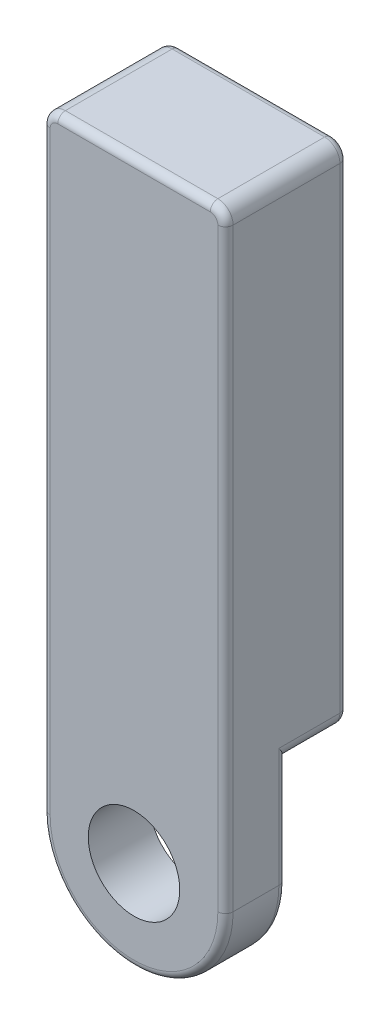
ISO-10303-21;
HEADER;
FILE_DESCRIPTION(('STEP AP214'),'2;1');
FILE_NAME('part.step','',(''),(''),'','','');
FILE_SCHEMA(('AUTOMOTIVE_DESIGN { 1 0 10303 214 1 1 1 1 }'));
ENDSEC;
DATA;
#1=APPLICATION_CONTEXT('core data for automotive mechanical design processes');
#2=APPLICATION_PROTOCOL_DEFINITION('international standard','automotive_design',2000,#1);
#3=PRODUCT_CONTEXT('',#1,'mechanical');
#4=PRODUCT('Part','Part','',(#3));
#5=PRODUCT_RELATED_PRODUCT_CATEGORY('part','',(#4));
#6=PRODUCT_DEFINITION_FORMATION('','',#4);
#7=PRODUCT_DEFINITION_CONTEXT('part definition',#1,'design');
#8=PRODUCT_DEFINITION('design','',#6,#7);
#9=PRODUCT_DEFINITION_SHAPE('','',#8);
#10=(LENGTH_UNIT() NAMED_UNIT(*) SI_UNIT(.MILLI.,.METRE.));
#11=(NAMED_UNIT(*) PLANE_ANGLE_UNIT() SI_UNIT($,.RADIAN.));
#12=(NAMED_UNIT(*) SI_UNIT($,.STERADIAN.) SOLID_ANGLE_UNIT());
#13=UNCERTAINTY_MEASURE_WITH_UNIT(LENGTH_MEASURE(1.E-05),#10,'distance_accuracy_value','');
#14=(GEOMETRIC_REPRESENTATION_CONTEXT(3) GLOBAL_UNCERTAINTY_ASSIGNED_CONTEXT((#13)) GLOBAL_UNIT_ASSIGNED_CONTEXT((#10,
#11,#12)) REPRESENTATION_CONTEXT('',''));
#15=CARTESIAN_POINT('',(0.,0.,0.));
#16=DIRECTION('',(0.,0.,1.));
#17=DIRECTION('',(1.,0.,0.));
#18=AXIS2_PLACEMENT_3D('',#15,#16,#17);
#19=CARTESIAN_POINT('',(0.,0.,25.4));
#20=DIRECTION('',(0.,0.,-1.));
#21=DIRECTION('',(-1.,0.,0.));
#22=AXIS2_PLACEMENT_3D('',#19,#20,#21);
#23=CYLINDRICAL_SURFACE('',#22,19.05);
#24=DIRECTION('',(0.,0.,-1.));
#25=VECTOR('',#24,1.);
#26=CARTESIAN_POINT('',(-19.05,0.,25.4));
#27=LINE('',#26,#25);
#28=CARTESIAN_POINT('',(-19.05,0.,23.8125));
#29=VERTEX_POINT('',#28);
#30=CARTESIAN_POINT('',(-19.05,0.,14.2875));
#31=VERTEX_POINT('',#30);
#32=EDGE_CURVE('E385',#29,#31,#27,.T.);
#33=ORIENTED_EDGE('',*,*,#32,.T.);
#34=CARTESIAN_POINT('',(0.,0.,14.2875));
#35=DIRECTION('',(0.,0.,-1.));
#36=DIRECTION('',(-1.,0.,0.));
#37=AXIS2_PLACEMENT_3D('',#34,#35,#36);
#38=CIRCLE('',#37,19.05);
#39=CARTESIAN_POINT('',(19.05,0.,14.2875));
#40=VERTEX_POINT('',#39);
#41=EDGE_CURVE('E273',#31,#40,#38,.F.);
#42=ORIENTED_EDGE('',*,*,#41,.T.);
#43=DIRECTION('',(0.,0.,-1.));
#44=VECTOR('',#43,1.);
#45=CARTESIAN_POINT('',(19.05,0.,25.4));
#46=LINE('',#45,#44);
#47=CARTESIAN_POINT('',(19.05,0.,23.8125));
#48=VERTEX_POINT('',#47);
#49=EDGE_CURVE('E201',#48,#40,#46,.T.);
#50=ORIENTED_EDGE('',*,*,#49,.F.);
#51=CARTESIAN_POINT('',(0.,0.,23.8125));
#52=DIRECTION('',(0.,0.,-1.));
#53=DIRECTION('',(-1.,0.,0.));
#54=AXIS2_PLACEMENT_3D('',#51,#52,#53);
#55=CIRCLE('',#54,19.05);
#56=EDGE_CURVE('E271',#48,#29,#55,.T.);
#57=ORIENTED_EDGE('',*,*,#56,.T.);
#58=EDGE_LOOP('',(#33,#42,#50,#57));
#59=FACE_BOUND('',#58,.T.);
#60=ADVANCED_FACE('F36',(#59),#23,.T.);
#61=CARTESIAN_POINT('',(0.,0.,25.4));
#62=DIRECTION('',(0.,0.,-1.));
#63=DIRECTION('',(-1.,0.,0.));
#64=AXIS2_PLACEMENT_3D('',#61,#62,#63);
#65=CYLINDRICAL_SURFACE('',#64,9.525);
#66=CARTESIAN_POINT('',(0.,0.,25.4));
#67=DIRECTION('',(0.,0.,1.));
#68=DIRECTION('',(1.,0.,0.));
#69=AXIS2_PLACEMENT_3D('',#66,#67,#68);
#70=CIRCLE('',#69,9.525);
#71=CARTESIAN_POINT('',(9.525,0.,25.4));
#72=VERTEX_POINT('',#71);
#73=EDGE_CURVE('E392',#72,#72,#70,.T.);
#74=ORIENTED_EDGE('',*,*,#73,.T.);
#75=EDGE_LOOP('',(#74));
#76=FACE_BOUND('',#75,.T.);
#77=CARTESIAN_POINT('',(0.,0.,12.7));
#78=DIRECTION('',(0.,0.,-1.));
#79=DIRECTION('',(-1.,0.,0.));
#80=AXIS2_PLACEMENT_3D('',#77,#78,#79);
#81=CIRCLE('',#80,9.525);
#82=CARTESIAN_POINT('',(-9.525,0.,12.7));
#83=VERTEX_POINT('',#82);
#84=EDGE_CURVE('E189',#83,#83,#81,.T.);
#85=ORIENTED_EDGE('',*,*,#84,.T.);
#86=EDGE_LOOP('',(#85));
#87=FACE_BOUND('',#86,.T.);
#88=ADVANCED_FACE('F375',(#76,#87),#65,.F.);
#89=CARTESIAN_POINT('',(0.,0.,25.4));
#90=DIRECTION('',(0.,0.,-1.));
#91=DIRECTION('',(-1.,0.,0.));
#92=AXIS2_PLACEMENT_3D('',#89,#90,#91);
#93=PLANE('',#92);
#94=DIRECTION('',(1.,0.,0.));
#95=VECTOR('',#94,1.);
#96=CARTESIAN_POINT('',(-15.875,125.4125,25.4));
#97=LINE('',#96,#95);
#98=CARTESIAN_POINT('',(15.875,125.4125,25.4));
#99=VERTEX_POINT('',#98);
#100=CARTESIAN_POINT('',(-15.875,125.4125,25.4));
#101=VERTEX_POINT('',#100);
#102=EDGE_CURVE('E249',#99,#101,#97,.F.);
#103=ORIENTED_EDGE('',*,*,#102,.T.);
#104=CARTESIAN_POINT('',(-15.875,123.825,25.4));
#105=DIRECTION('',(0.,0.,-1.));
#106=DIRECTION('',(-1.,0.,0.));
#107=AXIS2_PLACEMENT_3D('',#104,#105,#106);
#108=CIRCLE('',#107,1.5875);
#109=CARTESIAN_POINT('',(-17.4625,123.825,25.4));
#110=VERTEX_POINT('',#109);
#111=EDGE_CURVE('E251',#101,#110,#108,.F.);
#112=ORIENTED_EDGE('',*,*,#111,.T.);
#113=DIRECTION('',(0.,1.,0.));
#114=VECTOR('',#113,1.);
#115=CARTESIAN_POINT('',(-17.4625,0.,25.4));
#116=LINE('',#115,#114);
#117=CARTESIAN_POINT('',(-17.4625,0.,25.4));
#118=VERTEX_POINT('',#117);
#119=EDGE_CURVE('E247',#110,#118,#116,.F.);
#120=ORIENTED_EDGE('',*,*,#119,.T.);
#121=CARTESIAN_POINT('',(0.,0.,25.4));
#122=DIRECTION('',(0.,0.,-1.));
#123=DIRECTION('',(-1.,0.,0.));
#124=AXIS2_PLACEMENT_3D('',#121,#122,#123);
#125=CIRCLE('',#124,17.4625);
#126=CARTESIAN_POINT('',(17.4625,0.,25.4));
#127=VERTEX_POINT('',#126);
#128=EDGE_CURVE('E243',#118,#127,#125,.F.);
#129=ORIENTED_EDGE('',*,*,#128,.T.);
#130=DIRECTION('',(0.,-1.,0.));
#131=VECTOR('',#130,1.);
#132=CARTESIAN_POINT('',(17.4625,123.825,25.4));
#133=LINE('',#132,#131);
#134=CARTESIAN_POINT('',(17.4625,123.825,25.4));
#135=VERTEX_POINT('',#134);
#136=EDGE_CURVE('E241',#127,#135,#133,.F.);
#137=ORIENTED_EDGE('',*,*,#136,.T.);
#138=CARTESIAN_POINT('',(15.875,123.825,25.4));
#139=DIRECTION('',(0.,0.,-1.));
#140=DIRECTION('',(-1.,0.,0.));
#141=AXIS2_PLACEMENT_3D('',#138,#139,#140);
#142=CIRCLE('',#141,1.5875);
#143=EDGE_CURVE('E245',#135,#99,#142,.F.);
#144=ORIENTED_EDGE('',*,*,#143,.T.);
#145=EDGE_LOOP('',(#103,#112,#120,#129,#137,#144));
#146=FACE_BOUND('',#145,.T.);
#147=ORIENTED_EDGE('',*,*,#73,.F.);
#148=EDGE_LOOP('',(#147));
#149=FACE_BOUND('',#148,.T.);
#150=ADVANCED_FACE('F380',(#146,#149),#93,.F.);
#151=CARTESIAN_POINT('',(0.,0.,0.));
#152=DIRECTION('',(0.,0.,-1.));
#153=DIRECTION('',(-1.,0.,0.));
#154=AXIS2_PLACEMENT_3D('',#151,#152,#153);
#155=PLANE('',#154);
#156=CARTESIAN_POINT('',(-15.875,24.708457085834,0.));
#157=DIRECTION('',(0.,0.,-1.));
#158=DIRECTION('',(-1.,0.,0.));
#159=AXIS2_PLACEMENT_3D('',#156,#157,#158);
#160=CIRCLE('',#159,1.5875);
#161=CARTESIAN_POINT('',(-15.0168918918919,23.372864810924,0.));
#162=VERTEX_POINT('',#161);
#163=CARTESIAN_POINT('',(-17.4625,24.708457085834,0.));
#164=VERTEX_POINT('',#163);
#165=EDGE_CURVE('E226',#162,#164,#160,.T.);
#166=ORIENTED_EDGE('',*,*,#165,.T.);
#167=DIRECTION('',(0.,1.,0.));
#168=VECTOR('',#167,1.);
#169=CARTESIAN_POINT('',(-17.4625,0.,0.));
#170=LINE('',#169,#168);
#171=CARTESIAN_POINT('',(-17.4625,123.825,0.));
#172=VERTEX_POINT('',#171);
#173=EDGE_CURVE('E230',#164,#172,#170,.T.);
#174=ORIENTED_EDGE('',*,*,#173,.T.);
#175=CARTESIAN_POINT('',(-15.875,123.825,0.));
#176=DIRECTION('',(0.,0.,-1.));
#177=DIRECTION('',(-1.,0.,0.));
#178=AXIS2_PLACEMENT_3D('',#175,#176,#177);
#179=CIRCLE('',#178,1.5875);
#180=CARTESIAN_POINT('',(-15.875,125.4125,0.));
#181=VERTEX_POINT('',#180);
#182=EDGE_CURVE('E228',#172,#181,#179,.T.);
#183=ORIENTED_EDGE('',*,*,#182,.T.);
#184=DIRECTION('',(1.,0.,0.));
#185=VECTOR('',#184,1.);
#186=CARTESIAN_POINT('',(0.,125.4125,0.));
#187=LINE('',#186,#185);
#188=CARTESIAN_POINT('',(15.875,125.4125,0.));
#189=VERTEX_POINT('',#188);
#190=EDGE_CURVE('E224',#181,#189,#187,.T.);
#191=ORIENTED_EDGE('',*,*,#190,.T.);
#192=CARTESIAN_POINT('',(15.875,123.825,0.));
#193=DIRECTION('',(0.,0.,-1.));
#194=DIRECTION('',(-1.,0.,0.));
#195=AXIS2_PLACEMENT_3D('',#192,#193,#194);
#196=CIRCLE('',#195,1.5875);
#197=CARTESIAN_POINT('',(17.4625,123.825,0.));
#198=VERTEX_POINT('',#197);
#199=EDGE_CURVE('E220',#189,#198,#196,.T.);
#200=ORIENTED_EDGE('',*,*,#199,.T.);
#201=DIRECTION('',(0.,-1.,0.));
#202=VECTOR('',#201,1.);
#203=CARTESIAN_POINT('',(17.4625,0.,0.));
#204=LINE('',#203,#202);
#205=CARTESIAN_POINT('',(17.4625,24.708457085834,0.));
#206=VERTEX_POINT('',#205);
#207=EDGE_CURVE('E216',#198,#206,#204,.T.);
#208=ORIENTED_EDGE('',*,*,#207,.T.);
#209=CARTESIAN_POINT('',(15.875,24.708457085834,0.));
#210=DIRECTION('',(0.,0.,-1.));
#211=DIRECTION('',(-1.,0.,0.));
#212=AXIS2_PLACEMENT_3D('',#209,#210,#211);
#213=CIRCLE('',#212,1.5875);
#214=CARTESIAN_POINT('',(15.0168918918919,23.372864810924,0.));
#215=VERTEX_POINT('',#214);
#216=EDGE_CURVE('E218',#206,#215,#213,.T.);
#217=ORIENTED_EDGE('',*,*,#216,.T.);
#218=CARTESIAN_POINT('',(0.,0.,0.));
#219=DIRECTION('',(0.,0.,-1.));
#220=DIRECTION('',(-1.,0.,0.));
#221=AXIS2_PLACEMENT_3D('',#218,#219,#220);
#222=CIRCLE('',#221,27.78125);
#223=EDGE_CURVE('E222',#215,#162,#222,.F.);
#224=ORIENTED_EDGE('',*,*,#223,.T.);
#225=EDGE_LOOP('',(#166,#174,#183,#191,#200,#208,#217,#224));
#226=FACE_BOUND('',#225,.T.);
#227=ADVANCED_FACE('F411',(#226),#155,.T.);
#228=CARTESIAN_POINT('',(19.05,127.,25.4));
#229=DIRECTION('',(1.,0.,0.));
#230=DIRECTION('',(0.,1.,0.));
#231=AXIS2_PLACEMENT_3D('',#228,#229,#230);
#232=PLANE('',#231);
#233=ORIENTED_EDGE('',*,*,#49,.T.);
#234=DIRECTION('',(0.,1.,0.));
#235=VECTOR('',#234,1.);
#236=CARTESIAN_POINT('',(19.05,127.,14.2875));
#237=LINE('',#236,#235);
#238=CARTESIAN_POINT('',(19.05,24.708457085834,14.2875));
#239=VERTEX_POINT('',#238);
#240=EDGE_CURVE('E284',#40,#239,#237,.T.);
#241=ORIENTED_EDGE('',*,*,#240,.T.);
#242=DIRECTION('',(0.,0.,1.));
#243=VECTOR('',#242,1.);
#244=CARTESIAN_POINT('',(19.05,24.708457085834,0.));
#245=LINE('',#244,#243);
#246=CARTESIAN_POINT('',(19.05,24.708457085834,1.5875));
#247=VERTEX_POINT('',#246);
#248=EDGE_CURVE('E53',#239,#247,#245,.F.);
#249=ORIENTED_EDGE('',*,*,#248,.T.);
#250=DIRECTION('',(0.,-1.,0.));
#251=VECTOR('',#250,1.);
#252=CARTESIAN_POINT('',(19.05,127.,1.5875));
#253=LINE('',#252,#251);
#254=CARTESIAN_POINT('',(19.05,123.825,1.5875));
#255=VERTEX_POINT('',#254);
#256=EDGE_CURVE('E280',#247,#255,#253,.F.);
#257=ORIENTED_EDGE('',*,*,#256,.T.);
#258=DIRECTION('',(0.,0.,-1.));
#259=VECTOR('',#258,1.);
#260=CARTESIAN_POINT('',(19.05,123.825,25.4));
#261=LINE('',#260,#259);
#262=CARTESIAN_POINT('',(19.05,123.825,23.8125));
#263=VERTEX_POINT('',#262);
#264=EDGE_CURVE('E206',#255,#263,#261,.F.);
#265=ORIENTED_EDGE('',*,*,#264,.T.);
#266=DIRECTION('',(0.,-1.,0.));
#267=VECTOR('',#266,1.);
#268=CARTESIAN_POINT('',(19.05,0.,23.8125));
#269=LINE('',#268,#267);
#270=EDGE_CURVE('E282',#263,#48,#269,.T.);
#271=ORIENTED_EDGE('',*,*,#270,.T.);
#272=EDGE_LOOP('',(#233,#241,#249,#257,#265,#271));
#273=FACE_BOUND('',#272,.T.);
#274=ADVANCED_FACE('F415',(#273),#232,.T.);
#275=CARTESIAN_POINT('',(-19.05,127.,25.4));
#276=DIRECTION('',(0.,1.,0.));
#277=DIRECTION('',(0.,0.,1.));
#278=AXIS2_PLACEMENT_3D('',#275,#276,#277);
#279=PLANE('',#278);
#280=DIRECTION('',(0.,0.,-1.));
#281=VECTOR('',#280,1.);
#282=CARTESIAN_POINT('',(-15.875,127.,25.4));
#283=LINE('',#282,#281);
#284=CARTESIAN_POINT('',(-15.875,127.,1.5875));
#285=VERTEX_POINT('',#284);
#286=CARTESIAN_POINT('',(-15.875,127.,23.8125));
#287=VERTEX_POINT('',#286);
#288=EDGE_CURVE('E210',#285,#287,#283,.F.);
#289=ORIENTED_EDGE('',*,*,#288,.T.);
#290=DIRECTION('',(1.,0.,0.));
#291=VECTOR('',#290,1.);
#292=CARTESIAN_POINT('',(15.875,127.,23.8125));
#293=LINE('',#292,#291);
#294=CARTESIAN_POINT('',(15.875,127.,23.8125));
#295=VERTEX_POINT('',#294);
#296=EDGE_CURVE('E267',#287,#295,#293,.T.);
#297=ORIENTED_EDGE('',*,*,#296,.T.);
#298=DIRECTION('',(0.,0.,-1.));
#299=VECTOR('',#298,1.);
#300=CARTESIAN_POINT('',(15.875,127.,25.4));
#301=LINE('',#300,#299);
#302=CARTESIAN_POINT('',(15.875,127.,1.5875));
#303=VERTEX_POINT('',#302);
#304=EDGE_CURVE('E180',#295,#303,#301,.T.);
#305=ORIENTED_EDGE('',*,*,#304,.T.);
#306=DIRECTION('',(1.,0.,0.));
#307=VECTOR('',#306,1.);
#308=CARTESIAN_POINT('',(-19.05,127.,1.5875));
#309=LINE('',#308,#307);
#310=EDGE_CURVE('E265',#303,#285,#309,.F.);
#311=ORIENTED_EDGE('',*,*,#310,.T.);
#312=EDGE_LOOP('',(#289,#297,#305,#311));
#313=FACE_BOUND('',#312,.T.);
#314=ADVANCED_FACE('F419',(#313),#279,.T.);
#315=CARTESIAN_POINT('',(-19.05,0.,25.4));
#316=DIRECTION('',(-1.,0.,0.));
#317=DIRECTION('',(0.,0.,1.));
#318=AXIS2_PLACEMENT_3D('',#315,#316,#317);
#319=PLANE('',#318);
#320=DIRECTION('',(0.,0.,-1.));
#321=VECTOR('',#320,1.);
#322=CARTESIAN_POINT('',(-19.05,123.825,25.4));
#323=LINE('',#322,#321);
#324=CARTESIAN_POINT('',(-19.05,123.825,23.8125));
#325=VERTEX_POINT('',#324);
#326=CARTESIAN_POINT('',(-19.05,123.825,1.5875));
#327=VERTEX_POINT('',#326);
#328=EDGE_CURVE('E196',#325,#327,#323,.T.);
#329=ORIENTED_EDGE('',*,*,#328,.T.);
#330=DIRECTION('',(0.,1.,0.));
#331=VECTOR('',#330,1.);
#332=CARTESIAN_POINT('',(-19.05,0.,1.5875));
#333=LINE('',#332,#331);
#334=CARTESIAN_POINT('',(-19.05,24.708457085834,1.5875));
#335=VERTEX_POINT('',#334);
#336=EDGE_CURVE('E238',#327,#335,#333,.F.);
#337=ORIENTED_EDGE('',*,*,#336,.T.);
#338=DIRECTION('',(0.,0.,1.));
#339=VECTOR('',#338,1.);
#340=CARTESIAN_POINT('',(-19.05,24.708457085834,12.7));
#341=LINE('',#340,#339);
#342=CARTESIAN_POINT('',(-19.05,24.708457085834,14.2875));
#343=VERTEX_POINT('',#342);
#344=EDGE_CURVE('E199',#335,#343,#341,.T.);
#345=ORIENTED_EDGE('',*,*,#344,.T.);
#346=DIRECTION('',(0.,-1.,0.));
#347=VECTOR('',#346,1.);
#348=CARTESIAN_POINT('',(-19.05,0.,14.2875));
#349=LINE('',#348,#347);
#350=EDGE_CURVE('E235',#343,#31,#349,.T.);
#351=ORIENTED_EDGE('',*,*,#350,.T.);
#352=ORIENTED_EDGE('',*,*,#32,.F.);
#353=DIRECTION('',(0.,1.,0.));
#354=VECTOR('',#353,1.);
#355=CARTESIAN_POINT('',(-19.05,123.825,23.8125));
#356=LINE('',#355,#354);
#357=EDGE_CURVE('E233',#29,#325,#356,.T.);
#358=ORIENTED_EDGE('',*,*,#357,.T.);
#359=EDGE_LOOP('',(#329,#337,#345,#351,#352,#358));
#360=FACE_BOUND('',#359,.T.);
#361=ADVANCED_FACE('F406',(#360),#319,.T.);
#362=CARTESIAN_POINT('',(0.,0.,12.7));
#363=DIRECTION('',(0.,0.,-1.));
#364=DIRECTION('',(-1.,0.,0.));
#365=AXIS2_PLACEMENT_3D('',#362,#363,#364);
#366=CYLINDRICAL_SURFACE('',#365,26.19375);
#367=DIRECTION('',(0.,0.,-1.));
#368=VECTOR('',#367,1.);
#369=CARTESIAN_POINT('',(-14.1587837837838,22.0372725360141,12.7));
#370=LINE('',#369,#368);
#371=CARTESIAN_POINT('',(-14.1587837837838,22.0372725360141,12.7));
#372=VERTEX_POINT('',#371);
#373=CARTESIAN_POINT('',(-14.1587837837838,22.0372725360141,1.5875));
#374=VERTEX_POINT('',#373);
#375=EDGE_CURVE('E185',#372,#374,#370,.T.);
#376=ORIENTED_EDGE('',*,*,#375,.T.);
#377=CARTESIAN_POINT('',(0.,0.,1.5875));
#378=DIRECTION('',(0.,0.,-1.));
#379=DIRECTION('',(-1.,0.,0.));
#380=AXIS2_PLACEMENT_3D('',#377,#378,#379);
#381=CIRCLE('',#380,26.19375);
#382=CARTESIAN_POINT('',(14.1587837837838,22.0372725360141,1.5875));
#383=VERTEX_POINT('',#382);
#384=EDGE_CURVE('E269',#374,#383,#381,.T.);
#385=ORIENTED_EDGE('',*,*,#384,.T.);
#386=DIRECTION('',(0.,0.,-1.));
#387=VECTOR('',#386,1.);
#388=CARTESIAN_POINT('',(14.1587837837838,22.0372725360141,12.7));
#389=LINE('',#388,#387);
#390=CARTESIAN_POINT('',(14.1587837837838,22.0372725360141,12.7));
#391=VERTEX_POINT('',#390);
#392=EDGE_CURVE('E187',#383,#391,#389,.F.);
#393=ORIENTED_EDGE('',*,*,#392,.T.);
#394=CARTESIAN_POINT('',(0.,0.,12.7));
#395=DIRECTION('',(0.,0.,-1.));
#396=DIRECTION('',(-1.,0.,0.));
#397=AXIS2_PLACEMENT_3D('',#394,#395,#396);
#398=CIRCLE('',#397,26.19375);
#399=EDGE_CURVE('E172',#372,#391,#398,.T.);
#400=ORIENTED_EDGE('',*,*,#399,.F.);
#401=EDGE_LOOP('',(#376,#385,#393,#400));
#402=FACE_BOUND('',#401,.T.);
#403=ADVANCED_FACE('F184',(#402),#366,.F.);
#404=CARTESIAN_POINT('',(0.,0.,12.7));
#405=DIRECTION('',(0.,0.,-1.));
#406=DIRECTION('',(-1.,0.,0.));
#407=AXIS2_PLACEMENT_3D('',#404,#405,#406);
#408=PLANE('',#407);
#409=ORIENTED_EDGE('',*,*,#84,.F.);
#410=EDGE_LOOP('',(#409));
#411=FACE_BOUND('',#410,.T.);
#412=CARTESIAN_POINT('',(0.,0.,12.7));
#413=DIRECTION('',(0.,0.,-1.));
#414=DIRECTION('',(-1.,0.,0.));
#415=AXIS2_PLACEMENT_3D('',#412,#413,#414);
#416=CIRCLE('',#415,17.4625);
#417=CARTESIAN_POINT('',(17.4625,0.,12.7));
#418=VERTEX_POINT('',#417);
#419=CARTESIAN_POINT('',(-17.4625,0.,12.7));
#420=VERTEX_POINT('',#419);
#421=EDGE_CURVE('E262',#418,#420,#416,.T.);
#422=ORIENTED_EDGE('',*,*,#421,.T.);
#423=DIRECTION('',(0.,-1.,0.));
#424=VECTOR('',#423,1.);
#425=CARTESIAN_POINT('',(-17.4625,0.,12.7));
#426=LINE('',#425,#424);
#427=CARTESIAN_POINT('',(-17.4625,21.9588264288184,12.7));
#428=VERTEX_POINT('',#427);
#429=EDGE_CURVE('E174',#420,#428,#426,.F.);
#430=ORIENTED_EDGE('',*,*,#429,.T.);
#431=CARTESIAN_POINT('',(-15.875,24.708457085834,12.7));
#432=DIRECTION('',(0.,0.,-1.));
#433=DIRECTION('',(-1.,0.,0.));
#434=AXIS2_PLACEMENT_3D('',#431,#432,#433);
#435=CIRCLE('',#434,3.175);
#436=EDGE_CURVE('E168',#428,#372,#435,.F.);
#437=ORIENTED_EDGE('',*,*,#436,.T.);
#438=ORIENTED_EDGE('',*,*,#399,.T.);
#439=CARTESIAN_POINT('',(15.875,24.708457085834,12.7));
#440=DIRECTION('',(0.,0.,-1.));
#441=DIRECTION('',(-1.,0.,0.));
#442=AXIS2_PLACEMENT_3D('',#439,#440,#441);
#443=CIRCLE('',#442,3.175);
#444=CARTESIAN_POINT('',(17.4625,21.9588264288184,12.7));
#445=VERTEX_POINT('',#444);
#446=EDGE_CURVE('E179',#391,#445,#443,.F.);
#447=ORIENTED_EDGE('',*,*,#446,.T.);
#448=DIRECTION('',(0.,1.,0.));
#449=VECTOR('',#448,1.);
#450=CARTESIAN_POINT('',(17.4625,0.,12.7));
#451=LINE('',#450,#449);
#452=EDGE_CURVE('E260',#445,#418,#451,.F.);
#453=ORIENTED_EDGE('',*,*,#452,.T.);
#454=EDGE_LOOP('',(#422,#430,#437,#438,#447,#453));
#455=FACE_BOUND('',#454,.T.);
#456=ADVANCED_FACE('F170',(#411,#455),#408,.T.);
#457=CARTESIAN_POINT('',(-15.875,24.708457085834,12.7));
#458=DIRECTION('',(0.,0.,-1.));
#459=DIRECTION('',(-1.,0.,0.));
#460=AXIS2_PLACEMENT_3D('',#457,#458,#459);
#461=CYLINDRICAL_SURFACE('',#460,3.175);
#462=ORIENTED_EDGE('',*,*,#344,.F.);
#463=CARTESIAN_POINT('',(-15.875,24.708457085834,1.5875));
#464=DIRECTION('',(0.,0.,-1.));
#465=DIRECTION('',(-1.,0.,0.));
#466=AXIS2_PLACEMENT_3D('',#463,#464,#465);
#467=CIRCLE('',#466,3.175);
#468=EDGE_CURVE('E195',#335,#374,#467,.F.);
#469=ORIENTED_EDGE('',*,*,#468,.T.);
#470=ORIENTED_EDGE('',*,*,#375,.F.);
#471=ORIENTED_EDGE('',*,*,#436,.F.);
#472=CARTESIAN_POINT('',(-17.4625,21.9588264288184,12.7));
#473=CARTESIAN_POINT('',(-17.521966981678,21.9931353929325,12.6999996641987));
#474=CARTESIAN_POINT('',(-17.5802302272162,22.0293681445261,12.7033388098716));
#475=CARTESIAN_POINT('',(-17.693729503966,22.1051026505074,12.7158962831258));
#476=CARTESIAN_POINT('',(-17.7489728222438,22.1445959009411,12.7250997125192));
#477=CARTESIAN_POINT('',(-17.8554085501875,22.2259091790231,12.7484383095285));
#478=CARTESIAN_POINT('',(-17.9066449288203,22.2676914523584,12.7625065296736));
#479=CARTESIAN_POINT('',(-18.0056795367,22.3536461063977,12.7949091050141));
#480=CARTESIAN_POINT('',(-18.0534751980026,22.3978202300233,12.8132466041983));
#481=CARTESIAN_POINT('',(-18.2089383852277,22.5504820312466,12.8813437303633));
#482=CARTESIAN_POINT('',(-18.308353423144,22.6637142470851,12.9395829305));
#483=CARTESIAN_POINT('',(-18.4875391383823,22.8981422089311,13.0701906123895));
#484=CARTESIAN_POINT('',(-18.5671872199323,23.0193820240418,13.1426425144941));
#485=CARTESIAN_POINT('',(-18.686525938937,23.2299723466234,13.2739577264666));
#486=CARTESIAN_POINT('',(-18.7310597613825,23.3181077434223,13.3304719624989));
#487=CARTESIAN_POINT('',(-18.8110868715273,23.4962043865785,13.4469829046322));
#488=CARTESIAN_POINT('',(-18.8465768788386,23.5861662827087,13.5069808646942));
#489=CARTESIAN_POINT('',(-18.9087855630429,23.7672261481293,13.6293831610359));
#490=CARTESIAN_POINT('',(-18.9355185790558,23.8583220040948,13.6917833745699));
#491=CARTESIAN_POINT('',(-18.9805572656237,24.0413549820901,13.8182798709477));
#492=CARTESIAN_POINT('',(-18.9988636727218,24.1332920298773,13.8823760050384));
#493=CARTESIAN_POINT('',(-19.0372763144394,24.3829105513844,14.0573173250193));
#494=CARTESIAN_POINT('',(-19.0495287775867,24.5411831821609,14.169219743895));
#495=CARTESIAN_POINT('',(-19.0499955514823,24.7023228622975,14.2831624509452));
#496=CARTESIAN_POINT('',(-19.0499999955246,24.7053900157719,14.285331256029));
#497=CARTESIAN_POINT('',(-19.05,24.708457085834,14.2875));
#498=B_SPLINE_CURVE_WITH_KNOTS('',3,(#472,#473,#474,#475,#476,#477,#478,#479,#480,#481,#482,
#483,#484,#485,#486,#487,#488,#489,#490,#491,#492,#493,#494,#495,#496,#497),.UNSPECIFIED.,.F.,
.F.,(4,2,2,2,2,2,2,2,2,2,2,2,4),(0.,0.205727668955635,0.410934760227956,0.613423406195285,
0.816061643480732,1.29792832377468,1.78271280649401,2.12361551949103,2.46464170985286,
2.80510666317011,3.14554185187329,3.72632254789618,3.73759198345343),.UNSPECIFIED.);
#499=EDGE_CURVE('E46',#428,#343,#498,.T.);
#500=ORIENTED_EDGE('',*,*,#499,.T.);
#501=EDGE_LOOP('',(#462,#469,#470,#471,#500));
#502=FACE_BOUND('',#501,.T.);
#503=ADVANCED_FACE('F193',(#502),#461,.T.);
#504=CARTESIAN_POINT('',(15.875,24.708457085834,12.7));
#505=DIRECTION('',(0.,0.,-1.));
#506=DIRECTION('',(-1.,0.,0.));
#507=AXIS2_PLACEMENT_3D('',#504,#505,#506);
#508=CYLINDRICAL_SURFACE('',#507,3.175);
#509=ORIENTED_EDGE('',*,*,#392,.F.);
#510=CARTESIAN_POINT('',(15.875,24.708457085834,1.5875));
#511=DIRECTION('',(0.,0.,-1.));
#512=DIRECTION('',(-1.,0.,0.));
#513=AXIS2_PLACEMENT_3D('',#510,#511,#512);
#514=CIRCLE('',#513,3.175);
#515=EDGE_CURVE('E58',#383,#247,#514,.F.);
#516=ORIENTED_EDGE('',*,*,#515,.T.);
#517=ORIENTED_EDGE('',*,*,#248,.F.);
#518=CARTESIAN_POINT('',(17.4625,21.9588264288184,12.7));
#519=CARTESIAN_POINT('',(17.521966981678,21.9931353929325,12.6999996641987));
#520=CARTESIAN_POINT('',(17.5802302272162,22.0293681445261,12.7033388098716));
#521=CARTESIAN_POINT('',(17.693729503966,22.1051026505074,12.7158962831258));
#522=CARTESIAN_POINT('',(17.7489728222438,22.1445959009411,12.7250997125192));
#523=CARTESIAN_POINT('',(17.8554085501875,22.2259091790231,12.7484383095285));
#524=CARTESIAN_POINT('',(17.9066449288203,22.2676914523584,12.7625065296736));
#525=CARTESIAN_POINT('',(18.0056795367,22.3536461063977,12.7949091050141));
#526=CARTESIAN_POINT('',(18.0534751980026,22.3978202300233,12.8132466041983));
#527=CARTESIAN_POINT('',(18.2089383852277,22.5504820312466,12.8813437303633));
#528=CARTESIAN_POINT('',(18.308353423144,22.6637142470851,12.9395829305));
#529=CARTESIAN_POINT('',(18.4875391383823,22.8981422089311,13.0701906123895));
#530=CARTESIAN_POINT('',(18.5671872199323,23.0193820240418,13.1426425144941));
#531=CARTESIAN_POINT('',(18.6865259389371,23.2299723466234,13.2739577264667));
#532=CARTESIAN_POINT('',(18.7310597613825,23.3181077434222,13.3304719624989));
#533=CARTESIAN_POINT('',(18.8110868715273,23.4962043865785,13.4469829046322));
#534=CARTESIAN_POINT('',(18.8465768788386,23.5861662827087,13.5069808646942));
#535=CARTESIAN_POINT('',(18.9087855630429,23.7672261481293,13.6293831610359));
#536=CARTESIAN_POINT('',(18.9355185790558,23.8583220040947,13.69178337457));
#537=CARTESIAN_POINT('',(18.9805572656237,24.0413549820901,13.8182798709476));
#538=CARTESIAN_POINT('',(18.9988636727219,24.1332920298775,13.8823760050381));
#539=CARTESIAN_POINT('',(19.0372763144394,24.382910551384,14.0573173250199));
#540=CARTESIAN_POINT('',(19.0495287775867,24.5411831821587,14.1692197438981));
#541=CARTESIAN_POINT('',(19.0499955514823,24.7023228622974,14.2831624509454));
#542=CARTESIAN_POINT('',(19.0499999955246,24.7053900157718,14.2853312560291));
#543=CARTESIAN_POINT('',(19.05,24.708457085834,14.2875));
#544=B_SPLINE_CURVE_WITH_KNOTS('',3,(#518,#519,#520,#521,#522,#523,#524,#525,#526,#527,#528,
#529,#530,#531,#532,#533,#534,#535,#536,#537,#538,#539,#540,#541,#542,#543),.UNSPECIFIED.,.F.,
.F.,(4,2,2,2,2,2,2,2,2,2,2,2,4),(0.,0.205727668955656,0.410934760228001,0.613423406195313,
0.816061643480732,1.29792832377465,1.782712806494,2.12361551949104,2.46464170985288,
2.80510666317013,3.14554185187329,3.72632254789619,3.73759198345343),.UNSPECIFIED.);
#545=EDGE_CURVE('E11',#239,#445,#544,.F.);
#546=ORIENTED_EDGE('',*,*,#545,.T.);
#547=ORIENTED_EDGE('',*,*,#446,.F.);
#548=EDGE_LOOP('',(#509,#516,#517,#546,#547));
#549=FACE_BOUND('',#548,.T.);
#550=ADVANCED_FACE('F304',(#549),#508,.T.);
#551=CARTESIAN_POINT('',(15.875,123.825,25.4));
#552=DIRECTION('',(0.,0.,-1.));
#553=DIRECTION('',(-1.,0.,0.));
#554=AXIS2_PLACEMENT_3D('',#551,#552,#553);
#555=CYLINDRICAL_SURFACE('',#554,3.175);
#556=ORIENTED_EDGE('',*,*,#304,.F.);
#557=CARTESIAN_POINT('',(15.875,123.825,23.8125));
#558=DIRECTION('',(0.,0.,-1.));
#559=DIRECTION('',(-1.,0.,0.));
#560=AXIS2_PLACEMENT_3D('',#557,#558,#559);
#561=CIRCLE('',#560,3.175);
#562=EDGE_CURVE('E277',#295,#263,#561,.T.);
#563=ORIENTED_EDGE('',*,*,#562,.T.);
#564=ORIENTED_EDGE('',*,*,#264,.F.);
#565=CARTESIAN_POINT('',(15.875,123.825,1.5875));
#566=DIRECTION('',(0.,0.,-1.));
#567=DIRECTION('',(-1.,0.,0.));
#568=AXIS2_PLACEMENT_3D('',#565,#566,#567);
#569=CIRCLE('',#568,3.175);
#570=EDGE_CURVE('E275',#255,#303,#569,.F.);
#571=ORIENTED_EDGE('',*,*,#570,.T.);
#572=EDGE_LOOP('',(#556,#563,#564,#571));
#573=FACE_BOUND('',#572,.T.);
#574=ADVANCED_FACE('F309',(#573),#555,.T.);
#575=CARTESIAN_POINT('',(-15.875,123.825,25.4));
#576=DIRECTION('',(0.,0.,-1.));
#577=DIRECTION('',(-1.,0.,0.));
#578=AXIS2_PLACEMENT_3D('',#575,#576,#577);
#579=CYLINDRICAL_SURFACE('',#578,3.175);
#580=ORIENTED_EDGE('',*,*,#328,.F.);
#581=CARTESIAN_POINT('',(-15.875,123.825,23.8125));
#582=DIRECTION('',(0.,0.,-1.));
#583=DIRECTION('',(-1.,0.,0.));
#584=AXIS2_PLACEMENT_3D('',#581,#582,#583);
#585=CIRCLE('',#584,3.175);
#586=EDGE_CURVE('E256',#325,#287,#585,.T.);
#587=ORIENTED_EDGE('',*,*,#586,.T.);
#588=ORIENTED_EDGE('',*,*,#288,.F.);
#589=CARTESIAN_POINT('',(-15.875,123.825,1.5875));
#590=DIRECTION('',(0.,0.,-1.));
#591=DIRECTION('',(-1.,0.,0.));
#592=AXIS2_PLACEMENT_3D('',#589,#590,#591);
#593=CIRCLE('',#592,3.175);
#594=EDGE_CURVE('E254',#285,#327,#593,.F.);
#595=ORIENTED_EDGE('',*,*,#594,.T.);
#596=EDGE_LOOP('',(#580,#587,#588,#595));
#597=FACE_BOUND('',#596,.T.);
#598=ADVANCED_FACE('F312',(#597),#579,.T.);
#599=CARTESIAN_POINT('',(17.4625,0.,1.5875));
#600=DIRECTION('',(0.,-1.,0.));
#601=DIRECTION('',(1.,0.,0.));
#602=AXIS2_PLACEMENT_3D('',#599,#600,#601);
#603=CYLINDRICAL_SURFACE('',#602,1.5875);
#604=CARTESIAN_POINT('',(17.4625,123.825,1.5875));
#605=DIRECTION('',(0.,1.,0.));
#606=DIRECTION('',(0.,0.,1.));
#607=AXIS2_PLACEMENT_3D('',#604,#605,#606);
#608=CIRCLE('',#607,1.5875);
#609=EDGE_CURVE('E455',#255,#198,#608,.T.);
#610=ORIENTED_EDGE('',*,*,#609,.F.);
#611=ORIENTED_EDGE('',*,*,#256,.F.);
#612=CARTESIAN_POINT('',(17.4625,24.708457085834,1.5875));
#613=DIRECTION('',(0.,-1.,0.));
#614=DIRECTION('',(0.,0.,-1.));
#615=AXIS2_PLACEMENT_3D('',#612,#613,#614);
#616=CIRCLE('',#615,1.5875);
#617=EDGE_CURVE('E190',#206,#247,#616,.T.);
#618=ORIENTED_EDGE('',*,*,#617,.F.);
#619=ORIENTED_EDGE('',*,*,#207,.F.);
#620=EDGE_LOOP('',(#610,#611,#618,#619));
#621=FACE_BOUND('',#620,.T.);
#622=ADVANCED_FACE('F316',(#621),#603,.T.);
#623=CARTESIAN_POINT('',(15.875,24.708457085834,1.5875));
#624=DIRECTION('',(0.,0.,-1.));
#625=DIRECTION('',(-1.,0.,0.));
#626=AXIS2_PLACEMENT_3D('',#623,#624,#625);
#627=DEGENERATE_TOROIDAL_SURFACE('',#626,1.5875,1.5875,.T.);
#628=ORIENTED_EDGE('',*,*,#617,.T.);
#629=ORIENTED_EDGE('',*,*,#515,.F.);
#630=CARTESIAN_POINT('',(15.0168918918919,23.372864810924,1.5875));
#631=DIRECTION('',(-0.841317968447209,0.540540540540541,0.));
#632=DIRECTION('',(-0.540540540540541,-0.841317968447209,0.));
#633=AXIS2_PLACEMENT_3D('',#630,#631,#632);
#634=CIRCLE('',#633,1.5875);
#635=EDGE_CURVE('E452',#215,#383,#634,.T.);
#636=ORIENTED_EDGE('',*,*,#635,.F.);
#637=ORIENTED_EDGE('',*,*,#216,.F.);
#638=EDGE_LOOP('',(#628,#629,#636,#637));
#639=FACE_BOUND('',#638,.T.);
#640=ADVANCED_FACE('F342',(#639),#627,.T.);
#641=CARTESIAN_POINT('',(15.875,123.825,1.5875));
#642=DIRECTION('',(0.,0.,-1.));
#643=DIRECTION('',(-1.,0.,0.));
#644=AXIS2_PLACEMENT_3D('',#641,#642,#643);
#645=DEGENERATE_TOROIDAL_SURFACE('',#644,1.5875,1.5875,.T.);
#646=ORIENTED_EDGE('',*,*,#609,.T.);
#647=ORIENTED_EDGE('',*,*,#199,.F.);
#648=CARTESIAN_POINT('',(15.875,125.4125,1.5875));
#649=DIRECTION('',(-1.,0.,0.));
#650=DIRECTION('',(0.,0.,1.));
#651=AXIS2_PLACEMENT_3D('',#648,#649,#650);
#652=CIRCLE('',#651,1.5875);
#653=EDGE_CURVE('E449',#303,#189,#652,.T.);
#654=ORIENTED_EDGE('',*,*,#653,.F.);
#655=ORIENTED_EDGE('',*,*,#570,.F.);
#656=EDGE_LOOP('',(#646,#647,#654,#655));
#657=FACE_BOUND('',#656,.T.);
#658=ADVANCED_FACE('F338',(#657),#645,.T.);
#659=CARTESIAN_POINT('',(0.,0.,1.5875));
#660=DIRECTION('',(0.,0.,-1.));
#661=DIRECTION('',(-1.,0.,0.));
#662=AXIS2_PLACEMENT_3D('',#659,#660,#661);
#663=TOROIDAL_SURFACE('',#662,27.78125,1.5875);
#664=ORIENTED_EDGE('',*,*,#635,.T.);
#665=ORIENTED_EDGE('',*,*,#384,.F.);
#666=CARTESIAN_POINT('',(-15.0168918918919,23.372864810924,1.5875));
#667=DIRECTION('',(-0.84131796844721,-0.54054054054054,0.));
#668=DIRECTION('',(0.54054054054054,-0.84131796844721,0.));
#669=AXIS2_PLACEMENT_3D('',#666,#667,#668);
#670=CIRCLE('',#669,1.5875);
#671=EDGE_CURVE('E446',#162,#374,#670,.T.);
#672=ORIENTED_EDGE('',*,*,#671,.F.);
#673=ORIENTED_EDGE('',*,*,#223,.F.);
#674=EDGE_LOOP('',(#664,#665,#672,#673));
#675=FACE_BOUND('',#674,.T.);
#676=ADVANCED_FACE('F334',(#675),#663,.T.);
#677=CARTESIAN_POINT('',(0.,125.4125,1.5875));
#678=DIRECTION('',(1.,0.,0.));
#679=DIRECTION('',(0.,0.,-1.));
#680=AXIS2_PLACEMENT_3D('',#677,#678,#679);
#681=CYLINDRICAL_SURFACE('',#680,1.5875);
#682=ORIENTED_EDGE('',*,*,#653,.T.);
#683=ORIENTED_EDGE('',*,*,#190,.F.);
#684=CARTESIAN_POINT('',(-15.875,125.4125,1.5875));
#685=DIRECTION('',(-1.,0.,0.));
#686=DIRECTION('',(0.,0.,1.));
#687=AXIS2_PLACEMENT_3D('',#684,#685,#686);
#688=CIRCLE('',#687,1.5875);
#689=EDGE_CURVE('E439',#285,#181,#688,.T.);
#690=ORIENTED_EDGE('',*,*,#689,.F.);
#691=ORIENTED_EDGE('',*,*,#310,.F.);
#692=EDGE_LOOP('',(#682,#683,#690,#691));
#693=FACE_BOUND('',#692,.T.);
#694=ADVANCED_FACE('F330',(#693),#681,.T.);
#695=CARTESIAN_POINT('',(-15.875,24.708457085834,1.5875));
#696=DIRECTION('',(0.,0.,-1.));
#697=DIRECTION('',(-1.,0.,0.));
#698=AXIS2_PLACEMENT_3D('',#695,#696,#697);
#699=DEGENERATE_TOROIDAL_SURFACE('',#698,1.5875,1.5875,.T.);
#700=ORIENTED_EDGE('',*,*,#671,.T.);
#701=ORIENTED_EDGE('',*,*,#468,.F.);
#702=CARTESIAN_POINT('',(-17.4625,24.708457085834,1.5875));
#703=DIRECTION('',(0.,1.,0.));
#704=DIRECTION('',(0.,0.,1.));
#705=AXIS2_PLACEMENT_3D('',#702,#703,#704);
#706=CIRCLE('',#705,1.5875);
#707=EDGE_CURVE('E435',#164,#335,#706,.T.);
#708=ORIENTED_EDGE('',*,*,#707,.F.);
#709=ORIENTED_EDGE('',*,*,#165,.F.);
#710=EDGE_LOOP('',(#700,#701,#708,#709));
#711=FACE_BOUND('',#710,.T.);
#712=ADVANCED_FACE('F326',(#711),#699,.T.);
#713=CARTESIAN_POINT('',(-15.875,123.825,1.5875));
#714=DIRECTION('',(0.,0.,-1.));
#715=DIRECTION('',(-1.,0.,0.));
#716=AXIS2_PLACEMENT_3D('',#713,#714,#715);
#717=DEGENERATE_TOROIDAL_SURFACE('',#716,1.5875,1.5875,.T.);
#718=ORIENTED_EDGE('',*,*,#689,.T.);
#719=ORIENTED_EDGE('',*,*,#182,.F.);
#720=CARTESIAN_POINT('',(-17.4625,123.825,1.5875));
#721=DIRECTION('',(0.,-1.,0.));
#722=DIRECTION('',(0.,0.,-1.));
#723=AXIS2_PLACEMENT_3D('',#720,#721,#722);
#724=CIRCLE('',#723,1.5875);
#725=EDGE_CURVE('E432',#327,#172,#724,.T.);
#726=ORIENTED_EDGE('',*,*,#725,.F.);
#727=ORIENTED_EDGE('',*,*,#594,.F.);
#728=EDGE_LOOP('',(#718,#719,#726,#727));
#729=FACE_BOUND('',#728,.T.);
#730=ADVANCED_FACE('F322',(#729),#717,.T.);
#731=CARTESIAN_POINT('',(-17.4625,0.,1.5875));
#732=DIRECTION('',(0.,1.,0.));
#733=DIRECTION('',(0.,0.,1.));
#734=AXIS2_PLACEMENT_3D('',#731,#732,#733);
#735=CYLINDRICAL_SURFACE('',#734,1.5875);
#736=ORIENTED_EDGE('',*,*,#707,.T.);
#737=ORIENTED_EDGE('',*,*,#336,.F.);
#738=ORIENTED_EDGE('',*,*,#725,.T.);
#739=ORIENTED_EDGE('',*,*,#173,.F.);
#740=EDGE_LOOP('',(#736,#737,#738,#739));
#741=FACE_BOUND('',#740,.T.);
#742=ADVANCED_FACE('F318',(#741),#735,.T.);
#743=CARTESIAN_POINT('',(17.4625,127.,23.8125));
#744=DIRECTION('',(0.,1.,0.));
#745=DIRECTION('',(-1.,0.,0.));
#746=AXIS2_PLACEMENT_3D('',#743,#744,#745);
#747=CYLINDRICAL_SURFACE('',#746,1.5875);
#748=CARTESIAN_POINT('',(17.4625,0.,23.8125));
#749=DIRECTION('',(0.,-1.,0.));
#750=DIRECTION('',(1.,0.,0.));
#751=AXIS2_PLACEMENT_3D('',#748,#749,#750);
#752=CIRCLE('',#751,1.5875);
#753=EDGE_CURVE('E442',#48,#127,#752,.T.);
#754=ORIENTED_EDGE('',*,*,#753,.F.);
#755=ORIENTED_EDGE('',*,*,#270,.F.);
#756=CARTESIAN_POINT('',(17.4625,123.825,23.8125));
#757=DIRECTION('',(0.,1.,0.));
#758=DIRECTION('',(0.,0.,1.));
#759=AXIS2_PLACEMENT_3D('',#756,#757,#758);
#760=CIRCLE('',#759,1.5875);
#761=EDGE_CURVE('E438',#135,#263,#760,.T.);
#762=ORIENTED_EDGE('',*,*,#761,.F.);
#763=ORIENTED_EDGE('',*,*,#136,.F.);
#764=EDGE_LOOP('',(#754,#755,#762,#763));
#765=FACE_BOUND('',#764,.T.);
#766=ADVANCED_FACE('F321',(#765),#747,.T.);
#767=CARTESIAN_POINT('',(15.875,123.825,23.8125));
#768=DIRECTION('',(0.,0.,-1.));
#769=DIRECTION('',(-1.,0.,0.));
#770=AXIS2_PLACEMENT_3D('',#767,#768,#769);
#771=DEGENERATE_TOROIDAL_SURFACE('',#770,1.5875,1.5875,.T.);
#772=ORIENTED_EDGE('',*,*,#761,.T.);
#773=ORIENTED_EDGE('',*,*,#562,.F.);
#774=CARTESIAN_POINT('',(15.875,125.4125,23.8125));
#775=DIRECTION('',(-1.,0.,0.));
#776=DIRECTION('',(0.,0.,1.));
#777=AXIS2_PLACEMENT_3D('',#774,#775,#776);
#778=CIRCLE('',#777,1.5875);
#779=EDGE_CURVE('E467',#99,#295,#778,.T.);
#780=ORIENTED_EDGE('',*,*,#779,.F.);
#781=ORIENTED_EDGE('',*,*,#143,.F.);
#782=EDGE_LOOP('',(#772,#773,#780,#781));
#783=FACE_BOUND('',#782,.T.);
#784=ADVANCED_FACE('F365',(#783),#771,.T.);
#785=CARTESIAN_POINT('',(0.,0.,23.8125));
#786=DIRECTION('',(0.,0.,-1.));
#787=DIRECTION('',(-1.,0.,0.));
#788=AXIS2_PLACEMENT_3D('',#785,#786,#787);
#789=TOROIDAL_SURFACE('',#788,17.4625,1.5875);
#790=ORIENTED_EDGE('',*,*,#753,.T.);
#791=ORIENTED_EDGE('',*,*,#128,.F.);
#792=CARTESIAN_POINT('',(-17.4625,0.,23.8125));
#793=DIRECTION('',(0.,1.,0.));
#794=DIRECTION('',(0.,0.,1.));
#795=AXIS2_PLACEMENT_3D('',#792,#793,#794);
#796=CIRCLE('',#795,1.5875);
#797=EDGE_CURVE('E464',#29,#118,#796,.T.);
#798=ORIENTED_EDGE('',*,*,#797,.F.);
#799=ORIENTED_EDGE('',*,*,#56,.F.);
#800=EDGE_LOOP('',(#790,#791,#798,#799));
#801=FACE_BOUND('',#800,.T.);
#802=ADVANCED_FACE('F361',(#801),#789,.T.);
#803=CARTESIAN_POINT('',(-19.05,125.4125,23.8125));
#804=DIRECTION('',(-1.,0.,0.));
#805=DIRECTION('',(0.,0.,1.));
#806=AXIS2_PLACEMENT_3D('',#803,#804,#805);
#807=CYLINDRICAL_SURFACE('',#806,1.5875);
#808=ORIENTED_EDGE('',*,*,#779,.T.);
#809=ORIENTED_EDGE('',*,*,#296,.F.);
#810=CARTESIAN_POINT('',(-15.875,125.4125,23.8125));
#811=DIRECTION('',(-1.,0.,0.));
#812=DIRECTION('',(0.,0.,1.));
#813=AXIS2_PLACEMENT_3D('',#810,#811,#812);
#814=CIRCLE('',#813,1.5875);
#815=EDGE_CURVE('E462',#101,#287,#814,.T.);
#816=ORIENTED_EDGE('',*,*,#815,.F.);
#817=ORIENTED_EDGE('',*,*,#102,.F.);
#818=EDGE_LOOP('',(#808,#809,#816,#817));
#819=FACE_BOUND('',#818,.T.);
#820=ADVANCED_FACE('F357',(#819),#807,.T.);
#821=CARTESIAN_POINT('',(-17.4625,0.,23.8125));
#822=DIRECTION('',(0.,-1.,0.));
#823=DIRECTION('',(0.,0.,-1.));
#824=AXIS2_PLACEMENT_3D('',#821,#822,#823);
#825=CYLINDRICAL_SURFACE('',#824,1.5875);
#826=ORIENTED_EDGE('',*,*,#797,.T.);
#827=ORIENTED_EDGE('',*,*,#119,.F.);
#828=CARTESIAN_POINT('',(-17.4625,123.825,23.8125));
#829=DIRECTION('',(0.,1.,0.));
#830=DIRECTION('',(0.,0.,1.));
#831=AXIS2_PLACEMENT_3D('',#828,#829,#830);
#832=CIRCLE('',#831,1.5875);
#833=EDGE_CURVE('E460',#325,#110,#832,.T.);
#834=ORIENTED_EDGE('',*,*,#833,.F.);
#835=ORIENTED_EDGE('',*,*,#357,.F.);
#836=EDGE_LOOP('',(#826,#827,#834,#835));
#837=FACE_BOUND('',#836,.T.);
#838=ADVANCED_FACE('F353',(#837),#825,.T.);
#839=CARTESIAN_POINT('',(-15.875,123.825,23.8125));
#840=DIRECTION('',(0.,0.,-1.));
#841=DIRECTION('',(-1.,0.,0.));
#842=AXIS2_PLACEMENT_3D('',#839,#840,#841);
#843=DEGENERATE_TOROIDAL_SURFACE('',#842,1.5875,1.5875,.T.);
#844=ORIENTED_EDGE('',*,*,#815,.T.);
#845=ORIENTED_EDGE('',*,*,#586,.F.);
#846=ORIENTED_EDGE('',*,*,#833,.T.);
#847=ORIENTED_EDGE('',*,*,#111,.F.);
#848=EDGE_LOOP('',(#844,#845,#846,#847));
#849=FACE_BOUND('',#848,.T.);
#850=ADVANCED_FACE('F350',(#849),#843,.T.);
#851=CARTESIAN_POINT('',(17.4625,127.,14.2875));
#852=DIRECTION('',(0.,1.,0.));
#853=DIRECTION('',(-1.,0.,0.));
#854=AXIS2_PLACEMENT_3D('',#851,#852,#853);
#855=CYLINDRICAL_SURFACE('',#854,1.5875);
#856=ORIENTED_EDGE('',*,*,#545,.F.);
#857=ORIENTED_EDGE('',*,*,#240,.F.);
#858=CARTESIAN_POINT('',(17.4625,0.,14.2875));
#859=DIRECTION('',(0.,-1.,0.));
#860=DIRECTION('',(1.,0.,0.));
#861=AXIS2_PLACEMENT_3D('',#858,#859,#860);
#862=CIRCLE('',#861,1.5875);
#863=EDGE_CURVE('E41',#418,#40,#862,.T.);
#864=ORIENTED_EDGE('',*,*,#863,.F.);
#865=ORIENTED_EDGE('',*,*,#452,.F.);
#866=EDGE_LOOP('',(#856,#857,#864,#865));
#867=FACE_BOUND('',#866,.T.);
#868=ADVANCED_FACE('F38',(#867),#855,.T.);
#869=CARTESIAN_POINT('',(0.,0.,14.2875));
#870=DIRECTION('',(0.,0.,-1.));
#871=DIRECTION('',(-1.,0.,0.));
#872=AXIS2_PLACEMENT_3D('',#869,#870,#871);
#873=TOROIDAL_SURFACE('',#872,17.4625,1.5875);
#874=ORIENTED_EDGE('',*,*,#863,.T.);
#875=ORIENTED_EDGE('',*,*,#41,.F.);
#876=CARTESIAN_POINT('',(-17.4625,0.,14.2875));
#877=DIRECTION('',(0.,1.,0.));
#878=DIRECTION('',(0.,0.,1.));
#879=AXIS2_PLACEMENT_3D('',#876,#877,#878);
#880=CIRCLE('',#879,1.5875);
#881=EDGE_CURVE('E471',#420,#31,#880,.T.);
#882=ORIENTED_EDGE('',*,*,#881,.F.);
#883=ORIENTED_EDGE('',*,*,#421,.F.);
#884=EDGE_LOOP('',(#874,#875,#882,#883));
#885=FACE_BOUND('',#884,.T.);
#886=ADVANCED_FACE('F479',(#885),#873,.T.);
#887=CARTESIAN_POINT('',(-17.4625,0.,14.2875));
#888=DIRECTION('',(0.,-1.,0.));
#889=DIRECTION('',(0.,0.,-1.));
#890=AXIS2_PLACEMENT_3D('',#887,#888,#889);
#891=CYLINDRICAL_SURFACE('',#890,1.5875);
#892=ORIENTED_EDGE('',*,*,#499,.F.);
#893=ORIENTED_EDGE('',*,*,#429,.F.);
#894=ORIENTED_EDGE('',*,*,#881,.T.);
#895=ORIENTED_EDGE('',*,*,#350,.F.);
#896=EDGE_LOOP('',(#892,#893,#894,#895));
#897=FACE_BOUND('',#896,.T.);
#898=ADVANCED_FACE('F298',(#897),#891,.T.);
#899=CLOSED_SHELL('',(#60,#88,#150,#227,#274,#314,#361,#403,#456,#503,#550,#574,#598,#622,#640,
#658,#676,#694,#712,#730,#742,#766,#784,#802,#820,#838,#850,#868,#886,#898));
#900=MANIFOLD_SOLID_BREP('B2',#899);
#901=ADVANCED_BREP_SHAPE_REPRESENTATION('',(#18,#900),#14);
#902=SHAPE_DEFINITION_REPRESENTATION(#9,#901);
ENDSEC;
END-ISO-10303-21;
